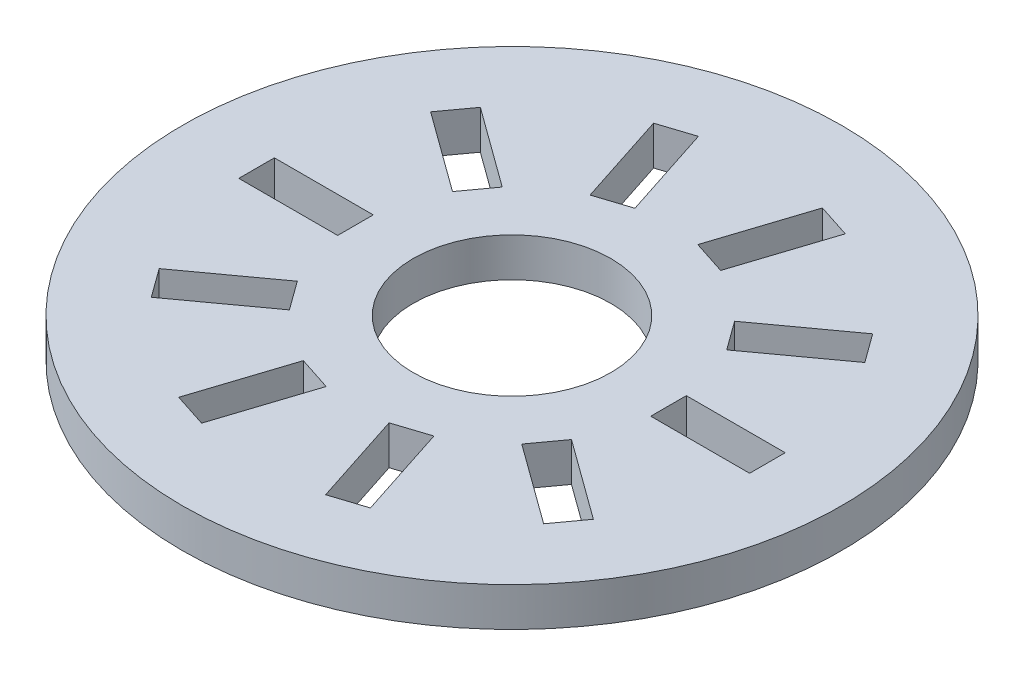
from build123d import *

# Parameters (mm, degrees)
SKETCH1_R           = 25.4
SKETCH1_R_2         = 7.62
SKETCH1_W           = 7.62
SKETCH1_H           = 2.7432
BOSS_EXTRUDE1_DEPTH = 2.9972


with BuildPart() as part:
    # Sketch1 → Boss-Extrude1 (new body)
    with BuildSketch(Plane(origin=(0, 0, 0), x_dir=(1, 0, 0), z_dir=(0, 1, 0))):
        with Locations(Location((0, 0, 0), (0, 0, 90))):
            Circle(SKETCH1_R)
        with Locations(Location((0, 0, 0), (0, 0, 90))):
            Circle(SKETCH1_R_2, mode=Mode.SUBTRACT)
        Polygon((10.566996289, -5.981981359), (16.731705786, -10.460904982), (15.119293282, -12.680200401), (8.954583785, -8.201276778), align=None, mode=Mode.SUBTRACT)
        with Locations((15.875, 0)):
            Rectangle(SKETCH1_W, SKETCH1_H, mode=Mode.SUBTRACT)
        Polygon((5.032759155, -11.05064916), (7.387468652, -18.297699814), (4.778530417, -19.145395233), (2.423820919, -11.898344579), align=None, mode=Mode.SUBTRACT)
        Polygon((-2.423820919, -11.898344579), (-4.778530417, -19.145395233), (-7.387468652, -18.297699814), (-5.032759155, -11.05064916), align=None, mode=Mode.SUBTRACT)
        Polygon((-8.954583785, -8.201276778), (-15.119293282, -12.680200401), (-16.731705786, -10.460904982), (-10.566996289, -5.981981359), align=None, mode=Mode.SUBTRACT)
        with Locations((-15.875, 0)):
            Rectangle(SKETCH1_W, SKETCH1_H, mode=Mode.SUBTRACT)
        Polygon((-10.566996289, 5.981981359), (-16.731705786, 10.460904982), (-15.119293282, 12.680200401), (-8.954583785, 8.201276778), align=None, mode=Mode.SUBTRACT)
        Polygon((-5.032759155, 11.05064916), (-7.387468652, 18.297699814), (-4.778530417, 19.145395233), (-2.423820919, 11.898344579), align=None, mode=Mode.SUBTRACT)
        Polygon((2.423820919, 11.898344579), (4.778530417, 19.145395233), (7.387468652, 18.297699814), (5.032759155, 11.05064916), align=None, mode=Mode.SUBTRACT)
        Polygon((8.954583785, 8.201276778), (15.119293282, 12.680200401), (16.731705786, 10.460904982), (10.566996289, 5.981981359), align=None, mode=Mode.SUBTRACT)
    extrude(amount=BOSS_EXTRUDE1_DEPTH)


solid = part.part
